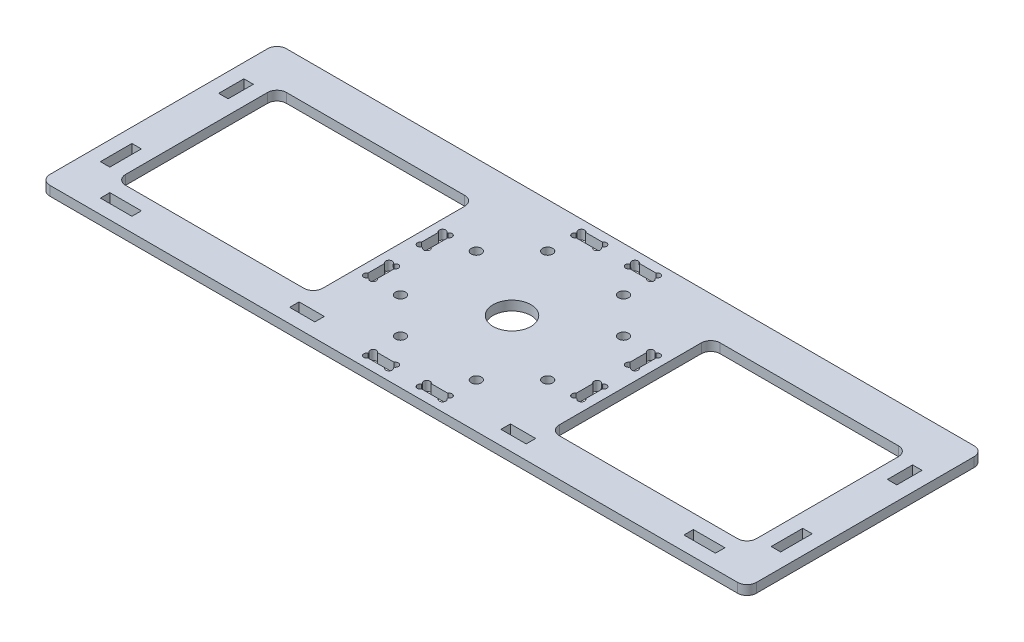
from build123d import *

# Parameters (mm, degrees)
SKETCH_2_W               = 224
SKETCH_2_H               = 75
SKETCH_2_W_2             = 62.5
SKETCH_2_H_2             = 51
EXTRUDE_1_DEPTH          = 3
FILLET_1_R               = 3
HOLE_WIZARD_3_2_3_2_1_D  = 3.2
SKETCH_6_R               = 6
CUT_EXTRUDE_2_DEPTH      = 10
CUT_EXTRUDE_3_DEPTH      = 119.149269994
CUT_EXTRUDE_3_DEPTH_BACK = 119.149269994
SKETCH_7_W               = 8
SKETCH_7_H               = 3
SKETCH_7_W_2             = 3
SKETCH_7_H_2             = 8
HOLE_WIZARD_2_0_2_1_D    = 2
SKETCH_10_W              = 10
SKETCH_10_H              = 3
SKETCH_10_W_2            = 3
SKETCH_10_H_2            = 10
SKETCH_10_W_3            = 8
SKETCH_10_H_3            = 8
CUT_EXTRUDE_4_DEPTH      = 10


with BuildPart() as part:
    # Sketch 2 → Extrude 1 (new body)
    with BuildSketch(Plane(origin=(0, 0, 0), x_dir=(1, 0, 0), z_dir=(0, 1, 0))):
        Rectangle(SKETCH_2_W, SKETCH_2_H)
        with Locations((68.75, 0)):
            Rectangle(SKETCH_2_W_2, SKETCH_2_H_2, mode=Mode.SUBTRACT)
        with Locations((-68.75, 0)):
            Rectangle(SKETCH_2_W_2, SKETCH_2_H_2, mode=Mode.SUBTRACT)
    extrude(amount=EXTRUDE_1_DEPTH)

    # Fillet 1
    fillet_1_edges = [part.edges().sort_by_distance(p)[0] for p in [
        (37.5, 1.5, -25.5),
        (37.5, 1.5, 25.5),
        (100, 1.5, 25.5),
        (100, 1.5, -25.5),
        (-37.5, 1.5, -25.5),
        (-100, 1.5, -25.5),
        (-100, 1.5, 25.5),
        (-37.5, 1.5, 25.5),
        (112, 1.5, 37.5),
        (-112, 1.5, 37.5),
        (-112, 1.5, -37.5),
        (112, 1.5, -37.5),
    ]]
    fillet(fillet_1_edges, radius=FILLET_1_R)

    # Hole Wizard 3.2 _3.2_ _1 (through all)
    with Locations(Plane(origin=(0, 3, 0), x_dir=(1, 0, 0), z_dir=(0, 1, 0))):
        with Locations((12.02081528, -23.334523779), (23.334523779, -12.02081528), (-12.02081528, 23.334523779), (-23.334523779, 12.02081528), (23.334523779, 12.02081528), (12.02081528, 23.334523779), (-23.334523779, -12.02081528), (-12.02081528, -23.334523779)):
            Hole(HOLE_WIZARD_3_2_3_2_1_D / 2)

    # Sketch 6 → Cut-Extrude 2 (cut)
    with BuildSketch(Plane(origin=(0, 3, 0), x_dir=(1, 0, 0), z_dir=(0, 1, 0))):
        with Locations(Location((0, 0, 0), (0, 0, 270))):
            Circle(SKETCH_6_R)
    extrude(amount=-CUT_EXTRUDE_2_DEPTH, mode=Mode.SUBTRACT)

    # Sketch 7 → Cut-Extrude 3 (cut, two sides: drawn at the far end of the back side and taken through both)
    with BuildSketch(Plane(origin=(0, 3, 0), x_dir=(1, 0, 0), z_dir=(0, 1, 0)).offset(-CUT_EXTRUDE_3_DEPTH_BACK)):
        with Locations((8.5, 33)):
            Rectangle(SKETCH_7_W, SKETCH_7_H)
        with Locations((-8.5, 33)):
            Rectangle(SKETCH_7_W, SKETCH_7_H)
        with Locations((8.5, -33)):
            Rectangle(SKETCH_7_W, SKETCH_7_H)
        with Locations((-8.5, -33)):
            Rectangle(SKETCH_7_W, SKETCH_7_H)
        with Locations((33, 8.5)):
            Rectangle(SKETCH_7_W_2, SKETCH_7_H_2)
        with Locations((33, -8.5)):
            Rectangle(SKETCH_7_W_2, SKETCH_7_H_2)
        with Locations((-33, 8.5)):
            Rectangle(SKETCH_7_W_2, SKETCH_7_H_2)
        with Locations((-33, -8.5)):
            Rectangle(SKETCH_7_W_2, SKETCH_7_H_2)
    extrude(amount=CUT_EXTRUDE_3_DEPTH + CUT_EXTRUDE_3_DEPTH_BACK, mode=Mode.SUBTRACT)

    # Hole Wizard 2.0 _2_ _1 (through all)
    with Locations(Plane(origin=(0, 3, 0), x_dir=(1, 0, 0), z_dir=(0, 1, 0))):
        with Locations((-34, 12), (-32, 12), (-32, 5), (-34, 5), (-32, -5), (-34, -5), (-32, -12), (-34, -12), (12, 34), (12, 32), (5, 34), (5, 32), (-5, 34), (-5, 32), (-12, 32), (-12, 34), (-12, -34), (-12, -32), (-5, -32), (-5, -34), (5, -32), (5, -34), (12, -32), (12, -34), (34, -12), (32, -12), (34, -5), (32, -5), (34, 5), (32, 5), (32, 12), (34, 12)):
            Hole(HOLE_WIZARD_2_0_2_1_D / 2)

    # Sketch 10 → Cut-Extrude 4 (cut)
    with BuildSketch(Plane(origin=(0, 3, 0), x_dir=(1, 0, 0), z_dir=(0, 1, 0))):
        with Locations((-92.5, -31.5)):
            Rectangle(SKETCH_10_W, SKETCH_10_H)
        with Locations((-106, -18)):
            Rectangle(SKETCH_10_W_2, SKETCH_10_H_2)
        with Locations((-33.5, -31.5)):
            Rectangle(SKETCH_10_W_3, SKETCH_10_H)
        with Locations((33.5, -31.5)):
            Rectangle(SKETCH_10_W_3, SKETCH_10_H)
        with Locations((106, -17.333985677)):
            Rectangle(SKETCH_10_W_2, SKETCH_10_H_2)
        with Locations((92.5, -31.5)):
            Rectangle(SKETCH_10_W, SKETCH_10_H)
        with Locations((106, 18.5)):
            Rectangle(SKETCH_10_W_2, SKETCH_10_H_3)
        with Locations((-106, 18.5)):
            Rectangle(SKETCH_10_W_2, SKETCH_10_H_3)
    extrude(amount=-CUT_EXTRUDE_4_DEPTH, mode=Mode.SUBTRACT)


solid = part.part
